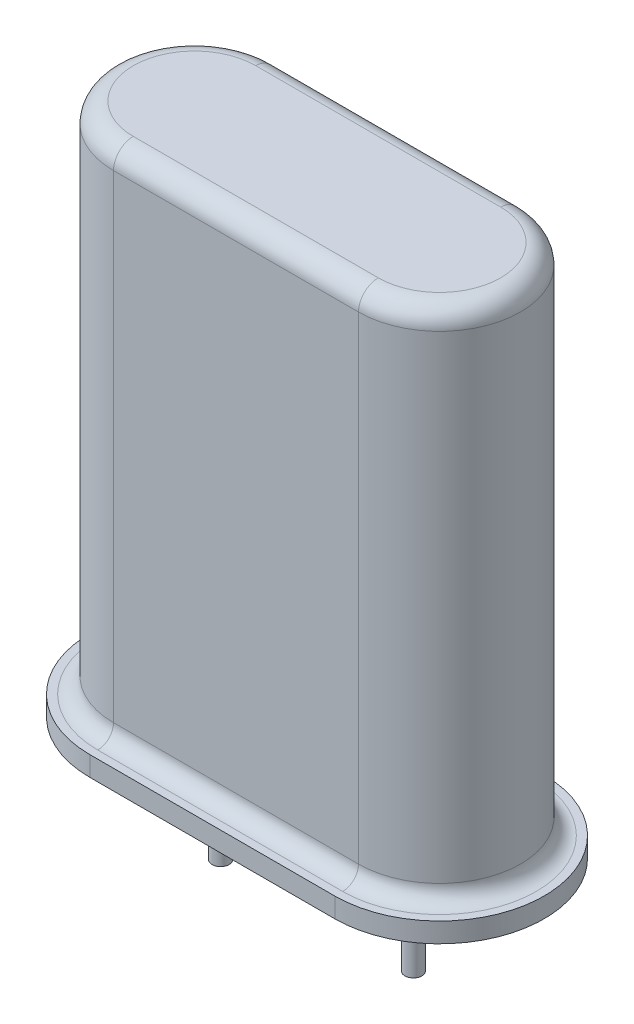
from build123d import *

# Parameters (mm, degrees)
EXTRUDE_1_DEPTH = 0.5
EXTRUDE_2_DEPTH = 13
FILLET_1_R      = 0.4
FILLET_2_R      = 0.5


with BuildPart() as part:
    # Sketch 2 → Revolve 1 (revolve)
    with BuildSketch(Plane.XY, mode=Mode.PRIVATE) as revolve_1_sk:
        with BuildLine():
            Line((-2.44, -2.5), (-2.225, -2.5))
            Line((-2.225, -2.5), (-2.225, 0))
            Line((-2.225, 0), (-2.127298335, 0))
            ThreePointArc((-2.127298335, 0), (-1.88234936, 0.083772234), (-1.74, 0.3))
            Line((-1.74, 0.3), (-2.44, 0.3))
            Line((-2.44, 0.3), (-2.44, -2.5))
        make_face()
    revolve_1 = revolve(revolve_1_sk.sketch.rotate(Axis((-2.44, -2.5, 0), (0, 1, 0)), 90), axis=Axis((-2.44, -2.5, 0), (0, 1, 0)))

    # Sketch 3 → Extrude 1 (add)
    with BuildSketch(Plane(origin=(0, 0.3, 0), x_dir=(-1, 0, 0), z_dir=(0, 1, 0))):
        with BuildLine():
            Line((3.1, 2.65), (-3.1, 2.65))
            ThreePointArc((-3.1, 2.65), (-5.75, 0), (-3.1, -2.65))
            Line((-3.1, -2.65), (3.1, -2.65))
            ThreePointArc((3.1, -2.65), (5.75, 0), (3.1, 2.65))
        make_face()
    extrude(amount=EXTRUDE_1_DEPTH)

    # Sketch 4 → Extrude 2 (add)
    with BuildSketch(Plane(origin=(0, 0.8, 0), x_dir=(-1, 0, 0), z_dir=(0, 1, 0))):
        with BuildLine():
            Line((3.1, 2.05), (-3.1, 2.05))
            ThreePointArc((-3.1, 2.05), (-5.15, 0), (-3.1, -2.05))
            Line((-3.1, -2.05), (3.1, -2.05))
            ThreePointArc((3.1, -2.05), (5.15, 0), (3.1, 2.05))
        make_face()
    extrude(amount=EXTRUDE_2_DEPTH)

    # Mirror 1: Revolve 1 across plane
    add(revolve_1.mirror(Plane(origin=(0, 0, 0), x_dir=(0, 0, 1), z_dir=(1, 0, 0))))

    # Fillet 1
    fillet_1_edges = [part.edges().sort_by_distance(p)[0] for p in [
        (0, 0.8, -2.05),
        (5.15, 0.8, 0),
        (0, 0.8, 2.05),
        (-5.15, 0.8, 0),
    ]]
    fillet(fillet_1_edges, radius=FILLET_1_R)

    # Fillet 2
    fillet_2_edges = [part.edges().sort_by_distance(p)[0] for p in [
        (0, 13.8, -2.05),
        (5.15, 13.8, 0),
        (0, 13.8, 2.05),
        (-5.15, 13.8, 0),
    ]]
    fillet(fillet_2_edges, radius=FILLET_2_R)


solid = part.part
